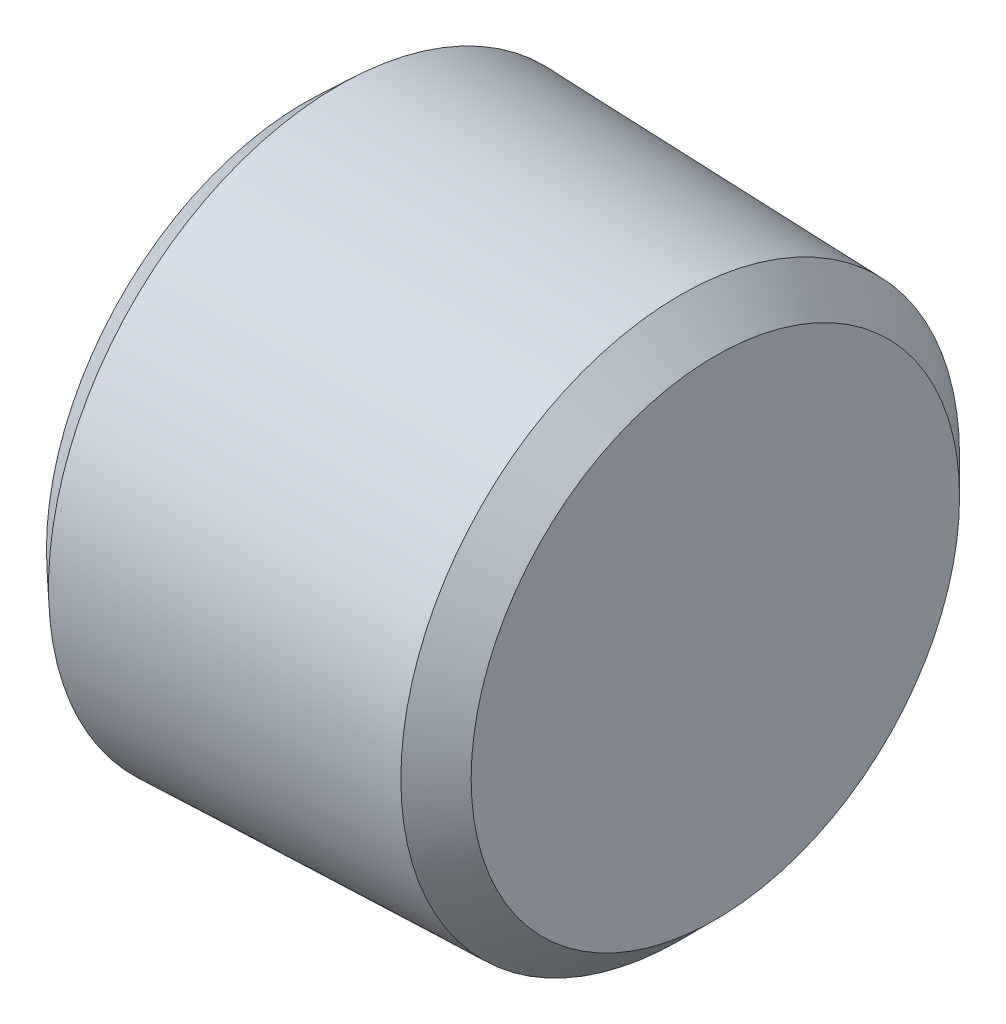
ISO-10303-21;
HEADER;
FILE_DESCRIPTION(('STEP AP214'),'2;1');
FILE_NAME('part.step','',(''),(''),'','','');
FILE_SCHEMA(('AUTOMOTIVE_DESIGN { 1 0 10303 214 1 1 1 1 }'));
ENDSEC;
DATA;
#1=APPLICATION_CONTEXT('core data for automotive mechanical design processes');
#2=APPLICATION_PROTOCOL_DEFINITION('international standard','automotive_design',2000,#1);
#3=PRODUCT_CONTEXT('',#1,'mechanical');
#4=PRODUCT('Part','Part','',(#3));
#5=PRODUCT_RELATED_PRODUCT_CATEGORY('part','',(#4));
#6=PRODUCT_DEFINITION_FORMATION('','',#4);
#7=PRODUCT_DEFINITION_CONTEXT('part definition',#1,'design');
#8=PRODUCT_DEFINITION('design','',#6,#7);
#9=PRODUCT_DEFINITION_SHAPE('','',#8);
#10=(LENGTH_UNIT() NAMED_UNIT(*) SI_UNIT(.MILLI.,.METRE.));
#11=(NAMED_UNIT(*) PLANE_ANGLE_UNIT() SI_UNIT($,.RADIAN.));
#12=(NAMED_UNIT(*) SI_UNIT($,.STERADIAN.) SOLID_ANGLE_UNIT());
#13=UNCERTAINTY_MEASURE_WITH_UNIT(LENGTH_MEASURE(1.E-05),#10,'distance_accuracy_value','');
#14=(GEOMETRIC_REPRESENTATION_CONTEXT(3) GLOBAL_UNCERTAINTY_ASSIGNED_CONTEXT((#13)) GLOBAL_UNIT_ASSIGNED_CONTEXT((#10,
#11,#12)) REPRESENTATION_CONTEXT('',''));
#15=CARTESIAN_POINT('',(0.,0.,0.));
#16=DIRECTION('',(0.,0.,1.));
#17=DIRECTION('',(1.,0.,0.));
#18=AXIS2_PLACEMENT_3D('',#15,#16,#17);
#19=CARTESIAN_POINT('',(0.,0.,0.));
#20=DIRECTION('',(1.,0.,0.));
#21=DIRECTION('',(0.,0.,-1.));
#22=AXIS2_PLACEMENT_3D('',#19,#20,#21);
#23=PLANE('',#22);
#24=DIRECTION('',(0.,0.866025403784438,-0.5));
#25=VECTOR('',#24,1.);
#26=CARTESIAN_POINT('',(0.,0.,2.74818728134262));
#27=LINE('',#26,#25);
#28=CARTESIAN_POINT('',(0.,0.,2.74818728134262));
#29=VERTEX_POINT('',#28);
#30=CARTESIAN_POINT('',(0.,2.38,1.37409364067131));
#31=VERTEX_POINT('',#30);
#32=EDGE_CURVE('E106',#29,#31,#27,.T.);
#33=ORIENTED_EDGE('',*,*,#32,.F.);
#34=DIRECTION('',(0.,0.866025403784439,0.5));
#35=VECTOR('',#34,1.);
#36=CARTESIAN_POINT('',(0.,-2.38,1.37409364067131));
#37=LINE('',#36,#35);
#38=CARTESIAN_POINT('',(0.,-2.38,1.37409364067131));
#39=VERTEX_POINT('',#38);
#40=EDGE_CURVE('E32',#39,#29,#37,.T.);
#41=ORIENTED_EDGE('',*,*,#40,.F.);
#42=DIRECTION('',(0.,0.,1.));
#43=VECTOR('',#42,1.);
#44=CARTESIAN_POINT('',(0.,-2.38,-1.37409364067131));
#45=LINE('',#44,#43);
#46=CARTESIAN_POINT('',(0.,-2.38,-1.37409364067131));
#47=VERTEX_POINT('',#46);
#48=EDGE_CURVE('E115',#47,#39,#45,.T.);
#49=ORIENTED_EDGE('',*,*,#48,.F.);
#50=DIRECTION('',(0.,-0.866025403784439,0.5));
#51=VECTOR('',#50,1.);
#52=CARTESIAN_POINT('',(0.,0.,-2.74818728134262));
#53=LINE('',#52,#51);
#54=CARTESIAN_POINT('',(0.,0.,-2.74818728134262));
#55=VERTEX_POINT('',#54);
#56=EDGE_CURVE('E113',#55,#47,#53,.T.);
#57=ORIENTED_EDGE('',*,*,#56,.F.);
#58=DIRECTION('',(0.,-0.866025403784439,-0.5));
#59=VECTOR('',#58,1.);
#60=CARTESIAN_POINT('',(0.,2.38,-1.37409364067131));
#61=LINE('',#60,#59);
#62=CARTESIAN_POINT('',(0.,2.38,-1.37409364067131));
#63=VERTEX_POINT('',#62);
#64=EDGE_CURVE('E80',#63,#55,#61,.T.);
#65=ORIENTED_EDGE('',*,*,#64,.F.);
#66=DIRECTION('',(0.,0.,-1.));
#67=VECTOR('',#66,1.);
#68=CARTESIAN_POINT('',(0.,2.38,1.37409364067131));
#69=LINE('',#68,#67);
#70=EDGE_CURVE('E109',#31,#63,#69,.T.);
#71=ORIENTED_EDGE('',*,*,#70,.F.);
#72=EDGE_LOOP('',(#33,#41,#49,#57,#65,#71));
#73=FACE_BOUND('',#72,.T.);
#74=CARTESIAN_POINT('',(0.,0.,0.));
#75=DIRECTION('',(1.,0.,0.));
#76=DIRECTION('',(0.,0.,-1.));
#77=AXIS2_PLACEMENT_3D('',#74,#75,#76);
#78=CIRCLE('',#77,4.39555912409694);
#79=CARTESIAN_POINT('',(0.,0.,-4.39555912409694));
#80=VERTEX_POINT('',#79);
#81=EDGE_CURVE('E11',#80,#80,#78,.F.);
#82=ORIENTED_EDGE('',*,*,#81,.T.);
#83=EDGE_LOOP('',(#82));
#84=FACE_BOUND('',#83,.T.);
#85=ADVANCED_FACE('F17',(#73,#84),#23,.F.);
#86=CARTESIAN_POINT('',(7.,0.,0.));
#87=DIRECTION('',(-1.,0.,0.));
#88=DIRECTION('',(0.,0.,1.));
#89=AXIS2_PLACEMENT_3D('',#86,#87,#88);
#90=CONICAL_SURFACE('',#89,4.74041679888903,0.031119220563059);
#91=CARTESIAN_POINT('',(6.40136492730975,0.,0.));
#92=DIRECTION('',(1.,0.,0.));
#93=DIRECTION('',(0.,0.,-1.));
#94=AXIS2_PLACEMENT_3D('',#91,#92,#93);
#95=CIRCLE('',#94,4.75905187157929);
#96=CARTESIAN_POINT('',(6.40136492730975,0.,-4.75905187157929));
#97=VERTEX_POINT('',#96);
#98=EDGE_CURVE('E127',#97,#97,#95,.F.);
#99=ORIENTED_EDGE('',*,*,#98,.T.);
#100=EDGE_LOOP('',(#99));
#101=FACE_BOUND('',#100,.T.);
#102=CARTESIAN_POINT('',(0.579719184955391,0.,0.));
#103=DIRECTION('',(1.,0.,0.));
#104=DIRECTION('',(0.,0.,-1.));
#105=AXIS2_PLACEMENT_3D('',#102,#103,#104);
#106=CIRCLE('',#105,4.94027545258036);
#107=CARTESIAN_POINT('',(0.579719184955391,0.,-4.94027545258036));
#108=VERTEX_POINT('',#107);
#109=EDGE_CURVE('E119',#108,#108,#106,.T.);
#110=ORIENTED_EDGE('',*,*,#109,.T.);
#111=EDGE_LOOP('',(#110));
#112=FACE_BOUND('',#111,.T.);
#113=ADVANCED_FACE('F139',(#101,#112),#90,.T.);
#114=CARTESIAN_POINT('',(7.,4.74041679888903,0.));
#115=DIRECTION('',(-1.,0.,0.));
#116=DIRECTION('',(0.,0.,1.));
#117=AXIS2_PLACEMENT_3D('',#114,#115,#116);
#118=PLANE('',#117);
#119=CARTESIAN_POINT('',(7.,0.,0.));
#120=DIRECTION('',(-1.,0.,0.));
#121=DIRECTION('',(0.,0.,1.));
#122=AXIS2_PLACEMENT_3D('',#119,#120,#121);
#123=CIRCLE('',#122,4.16041679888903);
#124=CARTESIAN_POINT('',(7.,0.,4.16041679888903));
#125=VERTEX_POINT('',#124);
#126=EDGE_CURVE('E25',#125,#125,#123,.F.);
#127=ORIENTED_EDGE('',*,*,#126,.T.);
#128=EDGE_LOOP('',(#127));
#129=FACE_BOUND('',#128,.T.);
#130=ADVANCED_FACE('F132',(#129),#118,.F.);
#131=CARTESIAN_POINT('',(6.40136492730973,0.,0.));
#132=DIRECTION('',(-1.,0.,0.));
#133=DIRECTION('',(0.,0.,1.));
#134=AXIS2_PLACEMENT_3D('',#131,#132,#133);
#135=CONICAL_SURFACE('',#134,4.75905187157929,0.785398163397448);
#136=ORIENTED_EDGE('',*,*,#126,.F.);
#137=EDGE_LOOP('',(#136));
#138=FACE_BOUND('',#137,.T.);
#139=ORIENTED_EDGE('',*,*,#98,.F.);
#140=EDGE_LOOP('',(#139));
#141=FACE_BOUND('',#140,.T.);
#142=ADVANCED_FACE('F134',(#138,#141),#135,.T.);
#143=CARTESIAN_POINT('',(0.,0.,0.));
#144=DIRECTION('',(1.,0.,0.));
#145=DIRECTION('',(0.,0.,-1.));
#146=AXIS2_PLACEMENT_3D('',#143,#144,#145);
#147=CONICAL_SURFACE('',#146,4.39555912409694,0.754278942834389);
#148=ORIENTED_EDGE('',*,*,#109,.F.);
#149=EDGE_LOOP('',(#148));
#150=FACE_BOUND('',#149,.T.);
#151=ORIENTED_EDGE('',*,*,#81,.F.);
#152=EDGE_LOOP('',(#151));
#153=FACE_BOUND('',#152,.T.);
#154=ADVANCED_FACE('F19',(#150,#153),#147,.T.);
#155=CARTESIAN_POINT('',(2.,-2.38,1.37409364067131));
#156=DIRECTION('',(0.,-0.5,0.866025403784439));
#157=DIRECTION('',(0.,-0.866025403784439,-0.5));
#158=AXIS2_PLACEMENT_3D('',#155,#156,#157);
#159=PLANE('',#158);
#160=ORIENTED_EDGE('',*,*,#40,.T.);
#161=DIRECTION('',(-1.,0.,0.));
#162=VECTOR('',#161,1.);
#163=CARTESIAN_POINT('',(2.,0.,2.74818728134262));
#164=LINE('',#163,#162);
#165=CARTESIAN_POINT('',(2.,0.,2.74818728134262));
#166=VERTEX_POINT('',#165);
#167=EDGE_CURVE('E62',#166,#29,#164,.T.);
#168=ORIENTED_EDGE('',*,*,#167,.F.);
#169=DIRECTION('',(0.,0.866025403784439,0.5));
#170=VECTOR('',#169,1.);
#171=CARTESIAN_POINT('',(2.,-2.38,1.37409364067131));
#172=LINE('',#171,#170);
#173=CARTESIAN_POINT('',(2.,-2.38,1.37409364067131));
#174=VERTEX_POINT('',#173);
#175=EDGE_CURVE('E117',#174,#166,#172,.T.);
#176=ORIENTED_EDGE('',*,*,#175,.F.);
#177=DIRECTION('',(-1.,0.,0.));
#178=VECTOR('',#177,1.);
#179=CARTESIAN_POINT('',(2.,-2.38,1.37409364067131));
#180=LINE('',#179,#178);
#181=EDGE_CURVE('E40',#174,#39,#180,.T.);
#182=ORIENTED_EDGE('',*,*,#181,.T.);
#183=EDGE_LOOP('',(#160,#168,#176,#182));
#184=FACE_BOUND('',#183,.T.);
#185=ADVANCED_FACE('F147',(#184),#159,.F.);
#186=CARTESIAN_POINT('',(2.,-2.38,-1.37409364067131));
#187=DIRECTION('',(0.,-1.,0.));
#188=DIRECTION('',(0.,0.,-1.));
#189=AXIS2_PLACEMENT_3D('',#186,#187,#188);
#190=PLANE('',#189);
#191=ORIENTED_EDGE('',*,*,#48,.T.);
#192=ORIENTED_EDGE('',*,*,#181,.F.);
#193=DIRECTION('',(0.,0.,1.));
#194=VECTOR('',#193,1.);
#195=CARTESIAN_POINT('',(2.,-2.38,-1.37409364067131));
#196=LINE('',#195,#194);
#197=CARTESIAN_POINT('',(2.,-2.38,-1.37409364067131));
#198=VERTEX_POINT('',#197);
#199=EDGE_CURVE('E92',#198,#174,#196,.T.);
#200=ORIENTED_EDGE('',*,*,#199,.F.);
#201=DIRECTION('',(-1.,0.,0.));
#202=VECTOR('',#201,1.);
#203=CARTESIAN_POINT('',(2.,-2.38,-1.37409364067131));
#204=LINE('',#203,#202);
#205=EDGE_CURVE('E84',#198,#47,#204,.T.);
#206=ORIENTED_EDGE('',*,*,#205,.T.);
#207=EDGE_LOOP('',(#191,#192,#200,#206));
#208=FACE_BOUND('',#207,.T.);
#209=ADVANCED_FACE('F163',(#208),#190,.F.);
#210=CARTESIAN_POINT('',(2.,0.,-2.74818728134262));
#211=DIRECTION('',(0.,-0.5,-0.866025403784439));
#212=DIRECTION('',(0.,0.866025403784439,-0.5));
#213=AXIS2_PLACEMENT_3D('',#210,#211,#212);
#214=PLANE('',#213);
#215=ORIENTED_EDGE('',*,*,#56,.T.);
#216=ORIENTED_EDGE('',*,*,#205,.F.);
#217=DIRECTION('',(0.,-0.866025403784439,0.5));
#218=VECTOR('',#217,1.);
#219=CARTESIAN_POINT('',(2.,0.,-2.74818728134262));
#220=LINE('',#219,#218);
#221=CARTESIAN_POINT('',(2.,0.,-2.74818728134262));
#222=VERTEX_POINT('',#221);
#223=EDGE_CURVE('E88',#222,#198,#220,.T.);
#224=ORIENTED_EDGE('',*,*,#223,.F.);
#225=DIRECTION('',(-1.,0.,0.));
#226=VECTOR('',#225,1.);
#227=CARTESIAN_POINT('',(2.,0.,-2.74818728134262));
#228=LINE('',#227,#226);
#229=EDGE_CURVE('E73',#222,#55,#228,.T.);
#230=ORIENTED_EDGE('',*,*,#229,.T.);
#231=EDGE_LOOP('',(#215,#216,#224,#230));
#232=FACE_BOUND('',#231,.T.);
#233=ADVANCED_FACE('F89',(#232),#214,.F.);
#234=CARTESIAN_POINT('',(2.,2.38,-1.37409364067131));
#235=DIRECTION('',(0.,0.5,-0.866025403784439));
#236=DIRECTION('',(0.,0.866025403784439,0.5));
#237=AXIS2_PLACEMENT_3D('',#234,#235,#236);
#238=PLANE('',#237);
#239=ORIENTED_EDGE('',*,*,#64,.T.);
#240=ORIENTED_EDGE('',*,*,#229,.F.);
#241=DIRECTION('',(0.,-0.866025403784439,-0.5));
#242=VECTOR('',#241,1.);
#243=CARTESIAN_POINT('',(2.,2.38,-1.37409364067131));
#244=LINE('',#243,#242);
#245=CARTESIAN_POINT('',(2.,2.38,-1.37409364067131));
#246=VERTEX_POINT('',#245);
#247=EDGE_CURVE('E77',#246,#222,#244,.T.);
#248=ORIENTED_EDGE('',*,*,#247,.F.);
#249=DIRECTION('',(-1.,0.,0.));
#250=VECTOR('',#249,1.);
#251=CARTESIAN_POINT('',(2.,2.38,-1.37409364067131));
#252=LINE('',#251,#250);
#253=EDGE_CURVE('E85',#246,#63,#252,.T.);
#254=ORIENTED_EDGE('',*,*,#253,.T.);
#255=EDGE_LOOP('',(#239,#240,#248,#254));
#256=FACE_BOUND('',#255,.T.);
#257=ADVANCED_FACE('F75',(#256),#238,.F.);
#258=CARTESIAN_POINT('',(2.,2.38,1.37409364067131));
#259=DIRECTION('',(0.,1.,0.));
#260=DIRECTION('',(0.,0.,1.));
#261=AXIS2_PLACEMENT_3D('',#258,#259,#260);
#262=PLANE('',#261);
#263=ORIENTED_EDGE('',*,*,#70,.T.);
#264=ORIENTED_EDGE('',*,*,#253,.F.);
#265=DIRECTION('',(0.,0.,-1.));
#266=VECTOR('',#265,1.);
#267=CARTESIAN_POINT('',(2.,2.38,1.37409364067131));
#268=LINE('',#267,#266);
#269=CARTESIAN_POINT('',(2.,2.38,1.37409364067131));
#270=VERTEX_POINT('',#269);
#271=EDGE_CURVE('E98',#270,#246,#268,.T.);
#272=ORIENTED_EDGE('',*,*,#271,.F.);
#273=DIRECTION('',(-1.,0.,0.));
#274=VECTOR('',#273,1.);
#275=CARTESIAN_POINT('',(2.,2.38,1.37409364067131));
#276=LINE('',#275,#274);
#277=EDGE_CURVE('E122',#270,#31,#276,.T.);
#278=ORIENTED_EDGE('',*,*,#277,.T.);
#279=EDGE_LOOP('',(#263,#264,#272,#278));
#280=FACE_BOUND('',#279,.T.);
#281=ADVANCED_FACE('F167',(#280),#262,.F.);
#282=CARTESIAN_POINT('',(2.,0.,2.74818728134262));
#283=DIRECTION('',(0.,0.5,0.866025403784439));
#284=DIRECTION('',(0.,-0.866025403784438,0.5));
#285=AXIS2_PLACEMENT_3D('',#282,#283,#284);
#286=PLANE('',#285);
#287=ORIENTED_EDGE('',*,*,#32,.T.);
#288=ORIENTED_EDGE('',*,*,#277,.F.);
#289=DIRECTION('',(0.,0.866025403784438,-0.5));
#290=VECTOR('',#289,1.);
#291=CARTESIAN_POINT('',(2.,0.,2.74818728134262));
#292=LINE('',#291,#290);
#293=EDGE_CURVE('E100',#166,#270,#292,.T.);
#294=ORIENTED_EDGE('',*,*,#293,.F.);
#295=ORIENTED_EDGE('',*,*,#167,.T.);
#296=EDGE_LOOP('',(#287,#288,#294,#295));
#297=FACE_BOUND('',#296,.T.);
#298=ADVANCED_FACE('F164',(#297),#286,.F.);
#299=CARTESIAN_POINT('',(2.,0.,2.74818728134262));
#300=DIRECTION('',(-1.,0.,0.));
#301=DIRECTION('',(0.,0.,1.));
#302=AXIS2_PLACEMENT_3D('',#299,#300,#301);
#303=PLANE('',#302);
#304=ORIENTED_EDGE('',*,*,#175,.T.);
#305=ORIENTED_EDGE('',*,*,#293,.T.);
#306=ORIENTED_EDGE('',*,*,#271,.T.);
#307=ORIENTED_EDGE('',*,*,#247,.T.);
#308=ORIENTED_EDGE('',*,*,#223,.T.);
#309=ORIENTED_EDGE('',*,*,#199,.T.);
#310=EDGE_LOOP('',(#304,#305,#306,#307,#308,#309));
#311=FACE_BOUND('',#310,.T.);
#312=ADVANCED_FACE('F95',(#311),#303,.T.);
#313=CLOSED_SHELL('',(#85,#113,#130,#142,#154,#185,#209,#233,#257,#281,#298,#312));
#314=MANIFOLD_SOLID_BREP('B1',#313);
#315=ADVANCED_BREP_SHAPE_REPRESENTATION('',(#18,#314),#14);
#316=SHAPE_DEFINITION_REPRESENTATION(#9,#315);
ENDSEC;
END-ISO-10303-21;
